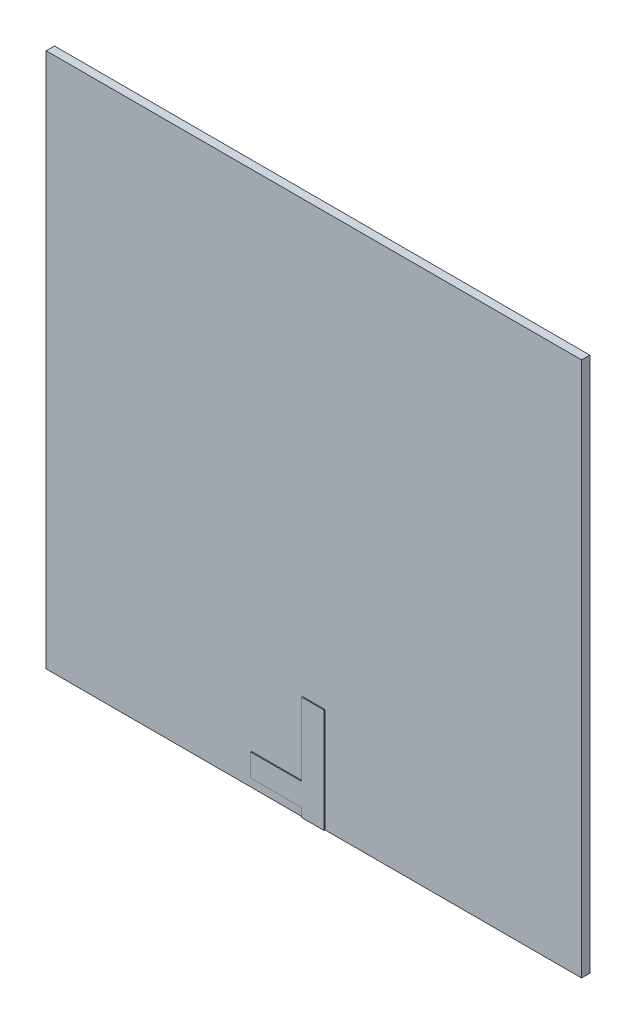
from build123d import *

# Parameters (mm, degrees)
CROQUIS1_W              = 110
CROQUIS1_H              = 110
SALIENTE_EXTRUIR1_DEPTH = 1.9
CORTAR_EXTRUIR1_DEPTH   = 0.2


with BuildPart() as part:
    # Croquis1 → Saliente-Extruir1 (new body)
    with BuildSketch(Plane.XY):
        Rectangle(CROQUIS1_W, CROQUIS1_H)
    extrude(amount=SALIENTE_EXTRUIR1_DEPTH)

    # Croquis7 → Cortar-Extruir1 (cut)
    with BuildSketch(Plane.XY.offset(1.9)):
        Polygon((-2.315, -55), (-55, -55), (-55, 55), (55, 55), (55, -55), (2.315, -55), (2.315, -33.575), (-2.315, -33.575), (-2.315, -48.575), (-12.815, -48.575), (-12.815, -53.205), (-2.315, -53.205), align=None)
    extrude(amount=-CORTAR_EXTRUIR1_DEPTH, mode=Mode.SUBTRACT)


solid = part.part
